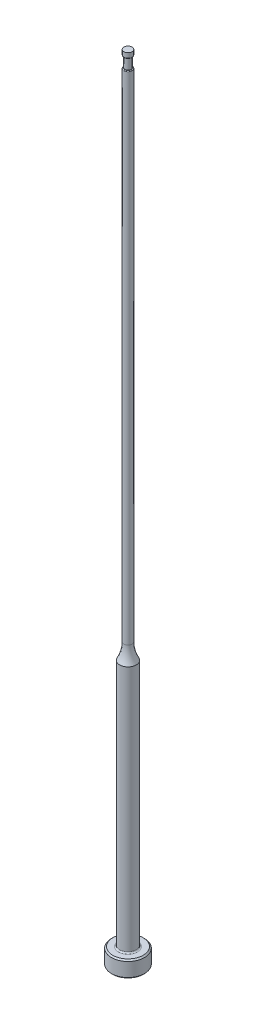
from build123d import *

# Parameters (mm, degrees)
CHAMFER1_SIZE     = 0.254
FILLET1_R         = 0.254
SKETCH2_W         = 0.2032
SKETCH2_H         = 2.032
D_SLOT_DEPTH      = 153.466131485
D_SLOT_DEPTH_BACK = 153.466131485
SKETCH5_W         = 0.00508
SKETCH5_H         = 1.016
FILLET2_R         = 0.127


with BuildPart() as part:
    # Sketch1 → Revolve1 (revolve)
    with BuildSketch(Plane.XY, mode=Mode.PRIVATE) as revolve1_sk:
        with BuildLine():
            Line((0, 0), (-3.175, 0))
            Line((-3.175, 0), (-3.175, 3.175))
            Line((-3.175, 3.175), (-1.5875, 3.175))
            Line((-1.5875, 3.175), (-1.5875, 50.8))
            ThreePointArc((-1.5875, 50.8), (-0.995388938, 52.286680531), (-0.79375, 53.874180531))
            Line((-0.79375, 53.874180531), (-0.79375, 152.4))
            Line((-0.79375, 152.4), (0, 152.4))
            Line((0, 152.4), (0, 0))
        make_face()
    revolve(revolve1_sk.sketch.rotate(Axis((0, 259.958771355, 0), (0, -1, 0)), 270), axis=Axis((0, 259.958771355, 0), (0, -1, 0)))

    # Chamfer1
    chamfer1_edges = [part.edges().sort_by_distance(p)[0] for p in [
        (0, 0, -3.175),
        (0, 3.175, -3.175),
    ]]
    chamfer(chamfer1_edges, length=CHAMFER1_SIZE)

    # Fillet1
    fillet1_edges = [part.edges().sort_by_distance(p)[0] for p in [
        (0, 3.175, -1.5875),
    ]]
    fillet(fillet1_edges, radius=FILLET1_R)

    # Sketch2 → Vent Relief (revolve, cut)
    with BuildSketch(Plane.XY, mode=Mode.PRIVATE) as vent_relief_sk:
        with Locations((-0.69215, 150.368)):
            Rectangle(SKETCH2_W, SKETCH2_H)
    revolve(vent_relief_sk.sketch.rotate(Axis((0, 153.448281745, 0), (0, -1, 0)), 270), axis=Axis((0, 153.448281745, 0), (0, -1, 0)), mode=Mode.SUBTRACT)

    # Sketch3 → D-Slot (cut, two sides: drawn at the far end of the back side and taken through both)
    with BuildSketch(Plane.XY.offset(-D_SLOT_DEPTH_BACK)):
        with BuildLine():
            Line((-0.59055, 150.368), (-0.59055, 112.268))
            ThreePointArc((-0.59055, 112.268), (-0.641763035, 111.700038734), (-0.79375, 111.1504))
            Line((-0.79375, 111.1504), (-0.79375, 150.368))
            Line((-0.79375, 150.368), (-0.59055, 150.368))
        make_face()
    extrude(amount=D_SLOT_DEPTH + D_SLOT_DEPTH_BACK, mode=Mode.SUBTRACT)

    # Sketch5 → Vent Diameter (revolve, cut)
    with BuildSketch(Plane.XY, mode=Mode.PRIVATE) as vent_diameter_sk:
        with Locations((-0.79121, 151.892)):
            Rectangle(SKETCH5_W, SKETCH5_H)
    revolve(vent_diameter_sk.sketch.rotate(Axis((0, 152.687735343, 0), (0, -1, 0)), 90), axis=Axis((0, 152.687735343, 0), (0, -1, 0)), mode=Mode.SUBTRACT)

    # Fillet2
    fillet2_edges = [part.edges().sort_by_distance(p)[0] for p in [
        (0.724920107, 149.352, -0.323310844),
        (0, 151.384, 0.78867),
    ]]
    fillet(fillet2_edges, radius=FILLET2_R)


solid = part.part
